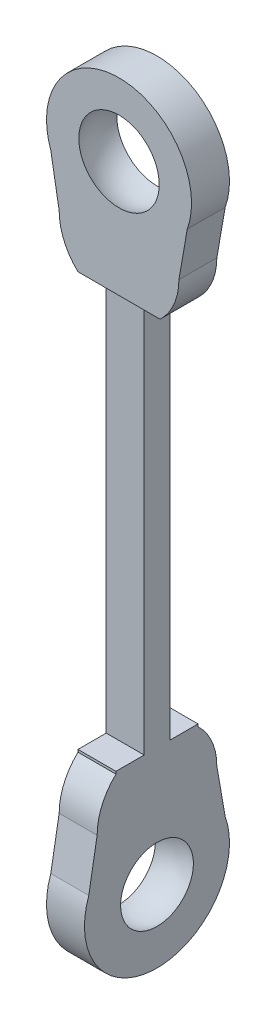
from build123d import *

# Parameters (mm, degrees)
SKETCH_1_R               = 3.532
SKETCH_1_R_2             = 2.165
EXTRUDE_1_DEPTH          = 2.849
EXTRUDE_START            = -2.849
EXTRUDE_3_DEPTH          = 2.849
EXTRUDE_4_DEPTH          = 2.849
SKETCH_5_W               = 4
SKETCH_5_H               = 8.802
EXTRUDE_5_DEPTH          = 2.849
EXTRUDE_6_DEPTH          = 2
EXTRUDE_6_DEPTH_BACK     = 2
SKETCH_11_R              = 2.165
SKETCH_12_W              = 1.376249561
SKETCH_12_H              = 19.360404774
SKETCH_12_W_2            = 1.095086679
CUT_EXTRUDE_1_DEPTH      = 24
CUT_EXTRUDE_2_DEPTH      = 24
CUT_EXTRUDE_2_DEPTH_BACK = 24
SKETCH_14_W              = 1.935032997
SKETCH_14_H              = 19.90949692
SKETCH_14_W_2            = 1.968594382
SKETCH_15_W              = 2.629097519
SKETCH_15_H              = 19.073490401
SKETCH_15_W_2            = 3.221303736
CUT_EXTRUDE_3_DEPTH      = 24
SKETCH_16_W              = 0.5
SKETCH_16_H              = 9.595959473
CUT_EXTRUDE_4_DEPTH      = 24
CUT_EXTRUDE_5_DEPTH      = 24
CUT_EXTRUDE_5_DEPTH_BACK = 24
SKETCH_17_W              = 1.075
SKETCH_17_H              = 30.344064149
SKETCH_19_R              = 2.165
EXTRUDE_7_DEPTH          = 1.849
SKETCH_21_R              = 2.165
EXTRUDE_9_DEPTH          = 1.85


with BuildPart() as part:
    # Sketch 1 → Extrude 1 (new body)
    with BuildSketch(Plane.XY):
        Circle(SKETCH_1_R)
        Circle(SKETCH_1_R_2, mode=Mode.SUBTRACT)
    extrude(amount=EXTRUDE_1_DEPTH)

    # Sketch 3 → Extrude 3 (add)
    with BuildSketch(Plane.XY.offset(2.849).offset(EXTRUDE_START)):
        with BuildLine():
            Line((-3.323475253, -1.195632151), (-2.916, -3.532))
            ThreePointArc((-2.916, -3.532), (0, -6.448), (2.916, -3.532))
            Line((2.916, -3.532), (3.323475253, -1.195632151))
            ThreePointArc((3.323475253, -1.195632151), (3.042882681, -1.79328999), (2.655959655, -2.328283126))
            ThreePointArc((2.655959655, -2.328283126), (-0.657357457, -3.470288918), (-3.323475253, -1.195632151))
        make_face()
    extrude(amount=EXTRUDE_3_DEPTH)

    # Sketch 4 → Extrude 4 (add)
    with BuildSketch(Plane.XY.offset(2.849).offset(EXTRUDE_START)):
        with BuildLine():
            ThreePointArc((2, -5.654040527), (1.075914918, -6.242251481), (0, -6.448))
            Line((0, -6.448), (2, -6.448))
            Line((2, -6.448), (2, -5.654040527))
        make_face()
        with BuildLine():
            Line((0, -6.448), (-2, -6.448))
            Line((-2, -6.448), (-2, -5.654040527))
            ThreePointArc((-2, -5.654040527), (-1.075914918, -6.242251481), (0, -6.448))
        make_face()
    extrude(amount=EXTRUDE_4_DEPTH)

    # Sketch 5 → Extrude 5 (add)
    with BuildSketch(Plane.XY.offset(2.849)):
        with Locations((0, -10.849)):
            Rectangle(SKETCH_5_W, SKETCH_5_H)
    extrude(amount=-EXTRUDE_5_DEPTH)

    # Sketch 11 → Extrude 6 (add, two sides: drawn at the far end of the back side and taken through both)
    with BuildSketch(Plane.ZY.offset(-EXTRUDE_6_DEPTH_BACK)):
        with BuildLine():
            Line((4.747975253, -29.304367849), (4.3405, -26.968))
            ThreePointArc((4.3405, -26.968), (4.101723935, -25.812349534), (3.4245, -24.845959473))
            Line((3.4245, -24.845959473), (3.4245, -15.25))
            Line((3.4245, -15.25), (-0.5755, -15.25))
            Line((-0.5755, -15.25), (-0.5755, -24.845959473))
            ThreePointArc((-0.5755, -24.845959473), (-1.252723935, -25.812349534), (-1.4915, -26.968))
            Line((-1.4915, -26.968), (-1.898975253, -29.304367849))
            ThreePointArc((-1.898975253, -29.304367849), (1.4245, -34.032), (4.747975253, -29.304367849))
        make_face()
        with Locations((1.4245, -30.5)):
            Circle(SKETCH_11_R, mode=Mode.SUBTRACT)
    extrude(amount=EXTRUDE_6_DEPTH + EXTRUDE_6_DEPTH_BACK)

    # Sketch 12 → Cut-Extrude 1 (cut)
    with BuildSketch(Plane.ZY.offset(12)):
        with Locations((-0.188124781, -5.556058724)):
            Rectangle(SKETCH_12_W, SKETCH_12_H)
        with Locations((2.896543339, -5.556058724)):
            Rectangle(SKETCH_12_W_2, SKETCH_12_H)
    extrude(amount=-CUT_EXTRUDE_1_DEPTH, mode=Mode.SUBTRACT)

    # Sketch 14 → Cut-Extrude 2 (cut, two sides: drawn at the far end of the back side and taken through both)
    with BuildSketch(Plane.XY.offset(3.4245).offset(-CUT_EXTRUDE_2_DEPTH_BACK)):
        with Locations((-2.467516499, -25.20474846)):
            Rectangle(SKETCH_14_W, SKETCH_14_H)
        with Locations((2.484297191, -25.20474846)):
            Rectangle(SKETCH_14_W_2, SKETCH_14_H)
    extrude(amount=CUT_EXTRUDE_2_DEPTH + CUT_EXTRUDE_2_DEPTH_BACK, mode=Mode.SUBTRACT)

    # Sketch 15 → Cut-Extrude 3 (cut)
    with BuildSketch(Plane.ZY.offset(12)):
        with Locations((-0.51454876, -15.190785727)):
            Rectangle(SKETCH_15_W, SKETCH_15_H)
        with Locations((3.659651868, -15.190785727)):
            Rectangle(SKETCH_15_W_2, SKETCH_15_H)
    extrude(amount=-CUT_EXTRUDE_3_DEPTH, mode=Mode.SUBTRACT)

    # Sketch 16 → Cut-Extrude 4 (cut)
    with BuildSketch(Plane(origin=(0, 0, 0.8), x_dir=(-1, 0, 0), z_dir=(0, 0, -1))):
        with Locations((-1.75, -10.452020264)):
            Rectangle(SKETCH_16_W, SKETCH_16_H)
        with Locations((1.75, -10.452020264)):
            Rectangle(SKETCH_16_W, SKETCH_16_H)
    extrude(amount=-CUT_EXTRUDE_4_DEPTH, mode=Mode.SUBTRACT)

    # Sketch 17 → Cut-Extrude 5 (cut, two sides: drawn at the far end of the back side and taken through both)
    with BuildSketch(Plane.XY.offset(2.049).offset(-CUT_EXTRUDE_5_DEPTH_BACK)):
        with Locations((-1.4625, -20.826072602)):
            Rectangle(SKETCH_17_W, SKETCH_17_H)
        with Locations((1.4625, -20.826072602)):
            Rectangle(SKETCH_17_W, SKETCH_17_H)
    extrude(amount=CUT_EXTRUDE_5_DEPTH + CUT_EXTRUDE_5_DEPTH_BACK, mode=Mode.SUBTRACT)

    # Sketch 19 → Extrude 7 (add)
    with BuildSketch(Plane(origin=(0, 0, 0.5), x_dir=(-1, 0, 0), z_dir=(0, 0, -1))):
        Circle(SKETCH_19_R)
    extrude(amount=-EXTRUDE_7_DEPTH)

    # Sketch 18 → Cut-Revolve 3 (revolve, cut)
    with BuildSketch(Plane(origin=(0, 0, 1.4245), x_dir=(-1, 0, 0), z_dir=(0, 0, -1))):
        with BuildLine():
            Line((0, 2.165), (0, -2.165))
            ThreePointArc((0, -2.165), (-2.165, 0), (0, 2.165))
        make_face()
    revolve(axis=Axis((0, 2.165, 1.4245), (0, -1, 0)), mode=Mode.SUBTRACT)

    # Sketch 21 → Extrude 9 (add)
    with BuildSketch(Plane(origin=(0.925, 0, 0), x_dir=(0, 0, -1), z_dir=(1, 0, 0))):
        with Locations((-1.4245, -30.5)):
            Circle(SKETCH_21_R)
    extrude(amount=-EXTRUDE_9_DEPTH)

    # Sketch 22 → Cut-Revolve 4 (revolve, cut)
    with BuildSketch(Plane.ZY):
        with BuildLine():
            Line((1.4245, -28.5), (1.4245, -32.5))
            ThreePointArc((1.4245, -32.5), (-0.5755, -30.5), (1.4245, -28.5))
        make_face()
    revolve(axis=Axis((0, -28.5, 1.4245), (0, -1, 0)), mode=Mode.SUBTRACT)


solid = part.part
